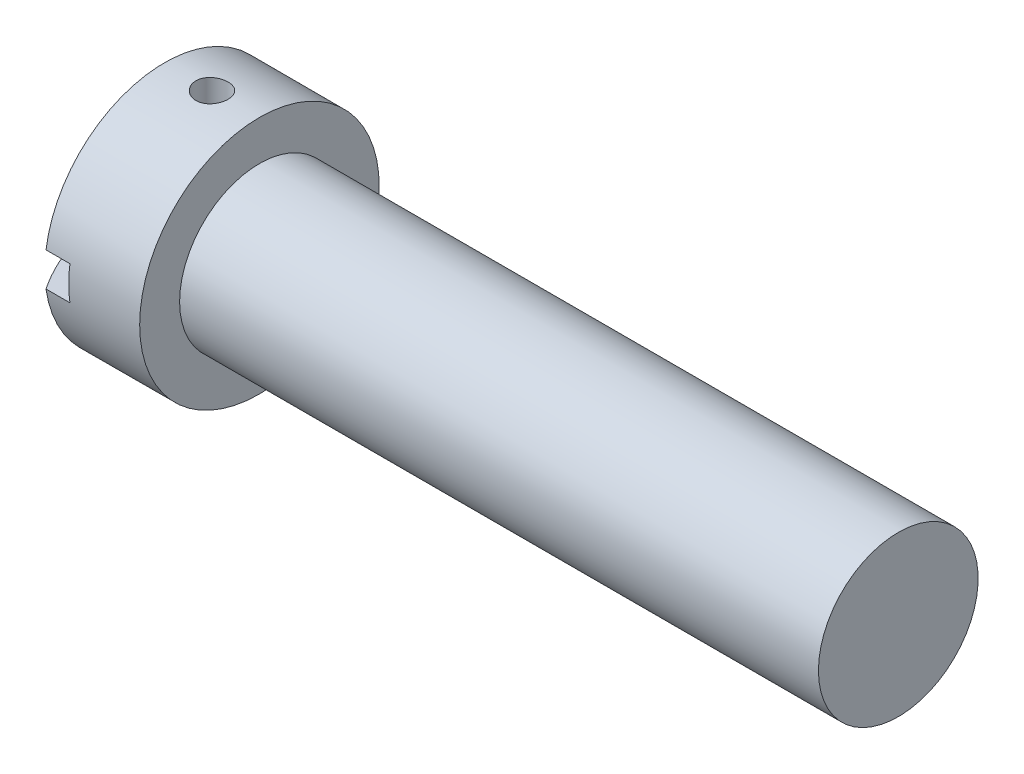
ISO-10303-21;
HEADER;
FILE_DESCRIPTION(('STEP AP214'),'2;1');
FILE_NAME('part.step','',(''),(''),'','','');
FILE_SCHEMA(('AUTOMOTIVE_DESIGN { 1 0 10303 214 1 1 1 1 }'));
ENDSEC;
DATA;
#1=APPLICATION_CONTEXT('core data for automotive mechanical design processes');
#2=APPLICATION_PROTOCOL_DEFINITION('international standard','automotive_design',2000,#1);
#3=PRODUCT_CONTEXT('',#1,'mechanical');
#4=PRODUCT('Part','Part','',(#3));
#5=PRODUCT_RELATED_PRODUCT_CATEGORY('part','',(#4));
#6=PRODUCT_DEFINITION_FORMATION('','',#4);
#7=PRODUCT_DEFINITION_CONTEXT('part definition',#1,'design');
#8=PRODUCT_DEFINITION('design','',#6,#7);
#9=PRODUCT_DEFINITION_SHAPE('','',#8);
#10=(LENGTH_UNIT() NAMED_UNIT(*) SI_UNIT(.MILLI.,.METRE.));
#11=(NAMED_UNIT(*) PLANE_ANGLE_UNIT() SI_UNIT($,.RADIAN.));
#12=(NAMED_UNIT(*) SI_UNIT($,.STERADIAN.) SOLID_ANGLE_UNIT());
#13=UNCERTAINTY_MEASURE_WITH_UNIT(LENGTH_MEASURE(1.E-05),#10,'distance_accuracy_value','');
#14=(GEOMETRIC_REPRESENTATION_CONTEXT(3) GLOBAL_UNCERTAINTY_ASSIGNED_CONTEXT((#13)) GLOBAL_UNIT_ASSIGNED_CONTEXT((#10,
#11,#12)) REPRESENTATION_CONTEXT('',''));
#15=CARTESIAN_POINT('',(0.,0.,0.));
#16=DIRECTION('',(0.,0.,1.));
#17=DIRECTION('',(1.,0.,0.));
#18=AXIS2_PLACEMENT_3D('',#15,#16,#17);
#19=CARTESIAN_POINT('',(16.9903913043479,0.,0.));
#20=DIRECTION('',(-1.,0.,0.));
#21=DIRECTION('',(0.,1.,0.));
#22=AXIS2_PLACEMENT_3D('',#19,#20,#21);
#23=SPHERICAL_SURFACE('',#22,16.9903913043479);
#24=CARTESIAN_POINT('',(2.921,0.,0.));
#25=DIRECTION('',(-1.,0.,0.));
#26=DIRECTION('',(0.,0.,1.));
#27=AXIS2_PLACEMENT_3D('',#24,#25,#26);
#28=CIRCLE('',#27,9.525);
#29=CARTESIAN_POINT('',(2.921,-1.3462,-9.42938866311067));
#30=VERTEX_POINT('',#29);
#31=CARTESIAN_POINT('',(2.921,-1.3462,9.42938866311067));
#32=VERTEX_POINT('',#31);
#33=EDGE_CURVE('E99',#30,#32,#28,.T.);
#34=ORIENTED_EDGE('',*,*,#33,.T.);
#35=CARTESIAN_POINT('',(16.9903913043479,-1.3462,0.));
#36=DIRECTION('',(0.,1.,0.));
#37=DIRECTION('',(0.,0.,1.));
#38=AXIS2_PLACEMENT_3D('',#35,#36,#37);
#39=CIRCLE('',#38,16.9369755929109);
#40=EDGE_CURVE('E162',#32,#30,#39,.F.);
#41=ORIENTED_EDGE('',*,*,#40,.T.);
#42=EDGE_LOOP('',(#34,#41));
#43=FACE_BOUND('',#42,.T.);
#44=ADVANCED_FACE('F39',(#43),#23,.T.);
#45=CARTESIAN_POINT('',(2.921,1.3462,9.42938866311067));
#46=VERTEX_POINT('',#45);
#47=CARTESIAN_POINT('',(2.921,1.3462,-9.42938866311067));
#48=VERTEX_POINT('',#47);
#49=EDGE_CURVE('E105',#46,#48,#28,.T.);
#50=ORIENTED_EDGE('',*,*,#49,.T.);
#51=CARTESIAN_POINT('',(16.9903913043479,1.3462,0.));
#52=DIRECTION('',(0.,-1.,0.));
#53=DIRECTION('',(0.,0.,-1.));
#54=AXIS2_PLACEMENT_3D('',#51,#52,#53);
#55=CIRCLE('',#54,16.9369755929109);
#56=EDGE_CURVE('E159',#48,#46,#55,.F.);
#57=ORIENTED_EDGE('',*,*,#56,.T.);
#58=EDGE_LOOP('',(#50,#57));
#59=FACE_BOUND('',#58,.T.);
#60=ADVANCED_FACE('F150',(#59),#23,.T.);
#61=CARTESIAN_POINT('',(-25.4,0.,0.));
#62=DIRECTION('',(-1.,0.,0.));
#63=DIRECTION('',(0.,0.,1.));
#64=AXIS2_PLACEMENT_3D('',#61,#62,#63);
#65=CYLINDRICAL_SURFACE('',#64,9.525);
#66=CARTESIAN_POINT('',(6.69289999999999,-9.43875337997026,1.27889));
#67=CARTESIAN_POINT('',(6.76438757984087,-9.43875447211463,1.27888698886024));
#68=CARTESIAN_POINT('',(6.83591872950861,-9.43957430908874,1.27287572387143));
#69=CARTESIAN_POINT('',(6.97698709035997,-9.44276349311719,1.24899246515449));
#70=CARTESIAN_POINT('',(7.04652219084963,-9.44513442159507,1.23110836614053));
#71=CARTESIAN_POINT('',(7.18153577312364,-9.45115251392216,1.18401897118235));
#72=CARTESIAN_POINT('',(7.24701709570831,-9.45479877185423,1.15482170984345));
#73=CARTESIAN_POINT('',(7.37213965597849,-9.46295559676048,1.08595263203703));
#74=CARTESIAN_POINT('',(7.43178182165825,-9.46746602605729,1.04628248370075));
#75=CARTESIAN_POINT('',(7.54392817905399,-9.47687548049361,0.957320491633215));
#76=CARTESIAN_POINT('',(7.59638933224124,-9.48177659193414,0.907974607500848));
#77=CARTESIAN_POINT('',(7.69231228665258,-9.49139647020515,0.801178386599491));
#78=CARTESIAN_POINT('',(7.73577362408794,-9.49611522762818,0.743727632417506));
#79=CARTESIAN_POINT('',(7.81261930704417,-9.5048602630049,0.622079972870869));
#80=CARTESIAN_POINT('',(7.84596444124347,-9.50888382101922,0.557858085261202));
#81=CARTESIAN_POINT('',(7.90137985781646,-9.51576211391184,0.424662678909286));
#82=CARTESIAN_POINT('',(7.92345062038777,-9.51861689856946,0.355689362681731));
#83=CARTESIAN_POINT('',(7.95556147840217,-9.52282128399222,0.215390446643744));
#84=CARTESIAN_POINT('',(7.96567334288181,-9.52417986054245,0.144081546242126));
#85=CARTESIAN_POINT('',(7.97380193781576,-9.52526944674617,0.000766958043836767));
#86=CARTESIAN_POINT('',(7.97181921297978,-9.52500052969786,-0.0712386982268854));
#87=CARTESIAN_POINT('',(7.95587211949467,-9.52287265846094,-0.213414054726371));
#88=CARTESIAN_POINT('',(7.94198494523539,-9.52102394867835,-0.283592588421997));
#89=CARTESIAN_POINT('',(7.90274400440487,-9.51595567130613,-0.420614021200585));
#90=CARTESIAN_POINT('',(7.87738999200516,-9.51273607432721,-0.487456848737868));
#91=CARTESIAN_POINT('',(7.81585406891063,-9.5052701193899,-0.616146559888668));
#92=CARTESIAN_POINT('',(7.7796390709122,-9.50102063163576,-0.677977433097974));
#93=CARTESIAN_POINT('',(7.69743328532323,-9.49196969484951,-0.794713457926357));
#94=CARTESIAN_POINT('',(7.65144198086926,-9.48716821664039,-0.84961824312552));
#95=CARTESIAN_POINT('',(7.55055755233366,-9.47750531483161,-0.951397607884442));
#96=CARTESIAN_POINT('',(7.49559710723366,-9.47264371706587,-0.998205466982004));
#97=CARTESIAN_POINT('',(7.37856489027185,-9.46344571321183,-1.08194286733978));
#98=CARTESIAN_POINT('',(7.3164930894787,-9.45910930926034,-1.11887236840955));
#99=CARTESIAN_POINT('',(7.18693718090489,-9.45145278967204,-1.1818103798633));
#100=CARTESIAN_POINT('',(7.11945018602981,-9.44813322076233,-1.20781301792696));
#101=CARTESIAN_POINT('',(6.98101287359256,-9.44289652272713,-1.24809724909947));
#102=CARTESIAN_POINT('',(6.91006274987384,-9.44097931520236,-1.26237949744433));
#103=CARTESIAN_POINT('',(6.76730398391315,-9.43877895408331,-1.27872807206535));
#104=CARTESIAN_POINT('',(6.69550630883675,-9.43848320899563,-1.28088853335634));
#105=CARTESIAN_POINT('',(6.55257311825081,-9.43952591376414,-1.27318107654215));
#106=CARTESIAN_POINT('',(6.48143758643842,-9.44086432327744,-1.26331345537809));
#107=CARTESIAN_POINT('',(6.34213338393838,-9.44501301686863,-1.23190940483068));
#108=CARTESIAN_POINT('',(6.27395414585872,-9.44781749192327,-1.21041901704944));
#109=CARTESIAN_POINT('',(6.14216637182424,-9.45457758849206,-1.15642703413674));
#110=CARTESIAN_POINT('',(6.07855801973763,-9.45853325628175,-1.12392499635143));
#111=CARTESIAN_POINT('',(5.95729309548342,-9.46718002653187,-1.04860273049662));
#112=CARTESIAN_POINT('',(5.8996750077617,-9.4718754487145,-1.00572104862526));
#113=CARTESIAN_POINT('',(5.79241987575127,-9.48145931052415,-0.91094311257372));
#114=CARTESIAN_POINT('',(5.74278319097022,-9.48634775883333,-0.859046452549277));
#115=CARTESIAN_POINT('',(5.6525666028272,-9.49580578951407,-0.747299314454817));
#116=CARTESIAN_POINT('',(5.612048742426,-9.50037305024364,-0.687398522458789));
#117=CARTESIAN_POINT('',(5.54165028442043,-9.50863892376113,-0.561586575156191));
#118=CARTESIAN_POINT('',(5.51176944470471,-9.51233755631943,-0.495675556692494));
#119=CARTESIAN_POINT('',(5.46359453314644,-9.51843918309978,-0.359915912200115));
#120=CARTESIAN_POINT('',(5.44526528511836,-9.52084610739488,-0.29007995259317));
#121=CARTESIAN_POINT('',(5.4205996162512,-9.52410950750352,-0.148287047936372));
#122=CARTESIAN_POINT('',(5.41426256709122,-9.5249660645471,-0.076330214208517));
#123=CARTESIAN_POINT('',(5.41377417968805,-9.52503168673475,0.0670574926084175));
#124=CARTESIAN_POINT('',(5.41952743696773,-9.52425365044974,0.13848805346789));
#125=CARTESIAN_POINT('',(5.44285343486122,-9.52116326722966,0.279356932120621));
#126=CARTESIAN_POINT('',(5.46042615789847,-9.51885092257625,0.34879525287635));
#127=CARTESIAN_POINT('',(5.50686090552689,-9.51295052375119,0.483691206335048));
#128=CARTESIAN_POINT('',(5.5357176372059,-9.50936306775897,0.549150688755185));
#129=CARTESIAN_POINT('',(5.60389132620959,-9.50130855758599,0.674313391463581));
#130=CARTESIAN_POINT('',(5.64320848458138,-9.49684148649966,0.734016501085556));
#131=CARTESIAN_POINT('',(5.7315372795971,-9.48748364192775,0.846458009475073));
#132=CARTESIAN_POINT('',(5.78061974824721,-9.48258992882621,0.899140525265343));
#133=CARTESIAN_POINT('',(5.88693765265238,-9.47295330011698,0.995557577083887));
#134=CARTESIAN_POINT('',(5.94417500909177,-9.4682104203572,1.03928999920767));
#135=CARTESIAN_POINT('',(6.06547378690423,-9.45938989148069,1.11673562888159));
#136=CARTESIAN_POINT('',(6.1295644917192,-9.4553153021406,1.15040330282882));
#137=CARTESIAN_POINT('',(6.26251128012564,-9.44832850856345,1.20644856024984));
#138=CARTESIAN_POINT('',(6.33136217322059,-9.4454150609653,1.22883822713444));
#139=CARTESIAN_POINT('',(6.4492780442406,-9.44177593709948,1.25642845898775));
#140=CARTESIAN_POINT('',(6.49760428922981,-9.4406482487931,1.26483915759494));
#141=CARTESIAN_POINT('',(6.59491353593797,-9.43913659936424,1.27607093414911));
#142=CARTESIAN_POINT('',(6.64389653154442,-9.43875263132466,1.27889206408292));
#143=CARTESIAN_POINT('',(6.69289999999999,-9.43875337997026,1.27889));
#144=B_SPLINE_CURVE_WITH_KNOTS('',3,(#66,#67,#68,#69,#70,#71,#72,#73,#74,#75,#76,#77,#78,#79,
#80,#81,#82,#83,#84,#85,#86,#87,#88,#89,#90,#91,#92,#93,#94,#95,#96,#97,#98,#99,#100,#101,#102,
#103,#104,#105,#106,#107,#108,#109,#110,#111,#112,#113,#114,#115,#116,#117,#118,#119,#120,#121,
#122,#123,#124,#125,#126,#127,#128,#129,#130,#131,#132,#133,#134,#135,#136,#137,#138,#139,#140,
#141,#142,#143),.UNSPECIFIED.,.T.,.F.,(4,2,2,2,2,2,2,2,2,2,2,2,2,2,2,2,2,2,2,2,2,2,2,2,2,2,2,2,
2,2,2,2,2,2,2,2,2,2,4),(0.,0.214283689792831,0.42878619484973,0.643136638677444,
0.857452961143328,1.07300223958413,1.28856262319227,1.50494816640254,1.72132449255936,
1.93639557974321,2.15145698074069,2.36513427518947,2.57881615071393,2.79315572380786,
3.00750663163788,3.22354742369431,3.43958909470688,3.65574672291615,3.87189226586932,
4.08635692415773,4.3008162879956,4.51443226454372,4.7280568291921,4.94297852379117,
5.15790989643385,5.37426216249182,5.59060950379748,5.80629481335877,6.02196882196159,
6.23594734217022,6.44992554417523,6.66380349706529,6.87768556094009,7.09317961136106,
7.30872450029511,7.52523026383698,7.74150356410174,7.88839260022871,8.03528027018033),.UNSPECIFIED.);
#145=CARTESIAN_POINT('',(6.69289999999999,-9.43875337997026,1.27889));
#146=VERTEX_POINT('',#145);
#147=EDGE_CURVE('E43',#146,#146,#144,.T.);
#148=ORIENTED_EDGE('',*,*,#147,.T.);
#149=EDGE_LOOP('',(#148));
#150=FACE_BOUND('',#149,.T.);
#151=CARTESIAN_POINT('',(6.69289999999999,9.43875337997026,1.27889));
#152=CARTESIAN_POINT('',(6.62141242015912,9.43875447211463,1.27888698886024));
#153=CARTESIAN_POINT('',(6.54988127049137,9.43957430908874,1.27287572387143));
#154=CARTESIAN_POINT('',(6.40881290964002,9.44276349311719,1.2489924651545));
#155=CARTESIAN_POINT('',(6.33927780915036,9.44513442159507,1.23110836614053));
#156=CARTESIAN_POINT('',(6.20426422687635,9.45115251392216,1.18401897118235));
#157=CARTESIAN_POINT('',(6.13878290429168,9.45479877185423,1.15482170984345));
#158=CARTESIAN_POINT('',(6.0136603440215,9.46295559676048,1.08595263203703));
#159=CARTESIAN_POINT('',(5.95401817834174,9.46746602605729,1.04628248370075));
#160=CARTESIAN_POINT('',(5.841871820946,9.47687548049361,0.957320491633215));
#161=CARTESIAN_POINT('',(5.78941066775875,9.48177659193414,0.907974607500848));
#162=CARTESIAN_POINT('',(5.69348771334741,9.49139647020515,0.801178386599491));
#163=CARTESIAN_POINT('',(5.65002637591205,9.49611522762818,0.743727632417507));
#164=CARTESIAN_POINT('',(5.57318069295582,9.5048602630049,0.622079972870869));
#165=CARTESIAN_POINT('',(5.53983555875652,9.50888382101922,0.557858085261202));
#166=CARTESIAN_POINT('',(5.48442014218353,9.51576211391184,0.424662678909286));
#167=CARTESIAN_POINT('',(5.46234937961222,9.51861689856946,0.355689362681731));
#168=CARTESIAN_POINT('',(5.43023852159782,9.52282128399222,0.215390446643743));
#169=CARTESIAN_POINT('',(5.42012665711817,9.52417986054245,0.144081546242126));
#170=CARTESIAN_POINT('',(5.41199806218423,9.52526944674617,0.000766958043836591));
#171=CARTESIAN_POINT('',(5.41398078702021,9.52500052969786,-0.0712386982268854));
#172=CARTESIAN_POINT('',(5.42992788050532,9.52287265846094,-0.213414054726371));
#173=CARTESIAN_POINT('',(5.4438150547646,9.52102394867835,-0.283592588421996));
#174=CARTESIAN_POINT('',(5.48305599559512,9.51595567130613,-0.420614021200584));
#175=CARTESIAN_POINT('',(5.50841000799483,9.51273607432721,-0.487456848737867));
#176=CARTESIAN_POINT('',(5.56994593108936,9.5052701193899,-0.616146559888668));
#177=CARTESIAN_POINT('',(5.60616092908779,9.50102063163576,-0.677977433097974));
#178=CARTESIAN_POINT('',(5.68836671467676,9.49196969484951,-0.794713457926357));
#179=CARTESIAN_POINT('',(5.73435801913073,9.48716821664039,-0.84961824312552));
#180=CARTESIAN_POINT('',(5.83524244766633,9.47750531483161,-0.951397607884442));
#181=CARTESIAN_POINT('',(5.89020289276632,9.47264371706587,-0.998205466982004));
#182=CARTESIAN_POINT('',(6.00723510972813,9.46344571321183,-1.08194286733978));
#183=CARTESIAN_POINT('',(6.06930691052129,9.45910930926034,-1.11887236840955));
#184=CARTESIAN_POINT('',(6.1988628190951,9.45145278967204,-1.1818103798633));
#185=CARTESIAN_POINT('',(6.26634981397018,9.44813322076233,-1.20781301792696));
#186=CARTESIAN_POINT('',(6.40478712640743,9.44289652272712,-1.24809724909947));
#187=CARTESIAN_POINT('',(6.47573725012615,9.44097931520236,-1.26237949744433));
#188=CARTESIAN_POINT('',(6.61849601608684,9.43877895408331,-1.27872807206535));
#189=CARTESIAN_POINT('',(6.69029369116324,9.43848320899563,-1.28088853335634));
#190=CARTESIAN_POINT('',(6.83322688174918,9.43952591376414,-1.27318107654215));
#191=CARTESIAN_POINT('',(6.90436241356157,9.44086432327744,-1.26331345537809));
#192=CARTESIAN_POINT('',(7.04366661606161,9.44501301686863,-1.23190940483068));
#193=CARTESIAN_POINT('',(7.11184585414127,9.44781749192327,-1.21041901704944));
#194=CARTESIAN_POINT('',(7.24363362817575,9.45457758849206,-1.15642703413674));
#195=CARTESIAN_POINT('',(7.30724198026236,9.45853325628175,-1.12392499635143));
#196=CARTESIAN_POINT('',(7.42850690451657,9.46718002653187,-1.04860273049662));
#197=CARTESIAN_POINT('',(7.48612499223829,9.4718754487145,-1.00572104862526));
#198=CARTESIAN_POINT('',(7.59338012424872,9.48145931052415,-0.91094311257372));
#199=CARTESIAN_POINT('',(7.64301680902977,9.48634775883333,-0.859046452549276));
#200=CARTESIAN_POINT('',(7.73323339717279,9.49580578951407,-0.747299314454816));
#201=CARTESIAN_POINT('',(7.77375125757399,9.50037305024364,-0.687398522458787));
#202=CARTESIAN_POINT('',(7.84414971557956,9.50863892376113,-0.56158657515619));
#203=CARTESIAN_POINT('',(7.87403055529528,9.51233755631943,-0.495675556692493));
#204=CARTESIAN_POINT('',(7.92220546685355,9.51843918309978,-0.359915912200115));
#205=CARTESIAN_POINT('',(7.94053471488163,9.52084610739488,-0.290079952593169));
#206=CARTESIAN_POINT('',(7.96520038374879,9.52410950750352,-0.148287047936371));
#207=CARTESIAN_POINT('',(7.97153743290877,9.5249660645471,-0.0763302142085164));
#208=CARTESIAN_POINT('',(7.97202582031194,9.52503168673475,0.0670574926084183));
#209=CARTESIAN_POINT('',(7.96627256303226,9.52425365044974,0.13848805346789));
#210=CARTESIAN_POINT('',(7.94294656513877,9.52116326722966,0.279356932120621));
#211=CARTESIAN_POINT('',(7.92537384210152,9.51885092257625,0.348795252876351));
#212=CARTESIAN_POINT('',(7.8789390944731,9.51295052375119,0.483691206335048));
#213=CARTESIAN_POINT('',(7.85008236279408,9.50936306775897,0.549150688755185));
#214=CARTESIAN_POINT('',(7.7819086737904,9.50130855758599,0.674313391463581));
#215=CARTESIAN_POINT('',(7.74259151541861,9.49684148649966,0.734016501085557));
#216=CARTESIAN_POINT('',(7.65426272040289,9.48748364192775,0.846458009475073));
#217=CARTESIAN_POINT('',(7.60518025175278,9.48258992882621,0.899140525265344));
#218=CARTESIAN_POINT('',(7.49886234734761,9.47295330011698,0.995557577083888));
#219=CARTESIAN_POINT('',(7.44162499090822,9.4682104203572,1.03928999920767));
#220=CARTESIAN_POINT('',(7.32032621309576,9.45938989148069,1.11673562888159));
#221=CARTESIAN_POINT('',(7.25623550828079,9.4553153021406,1.15040330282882));
#222=CARTESIAN_POINT('',(7.12328871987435,9.44832850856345,1.20644856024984));
#223=CARTESIAN_POINT('',(7.0544378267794,9.4454150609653,1.22883822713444));
#224=CARTESIAN_POINT('',(6.93652195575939,9.44177593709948,1.25642845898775));
#225=CARTESIAN_POINT('',(6.88819571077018,9.4406482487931,1.26483915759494));
#226=CARTESIAN_POINT('',(6.79088646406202,9.43913659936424,1.27607093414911));
#227=CARTESIAN_POINT('',(6.74190346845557,9.43875263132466,1.27889206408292));
#228=CARTESIAN_POINT('',(6.69289999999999,9.43875337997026,1.27889));
#229=B_SPLINE_CURVE_WITH_KNOTS('',3,(#151,#152,#153,#154,#155,#156,#157,#158,#159,#160,#161,
#162,#163,#164,#165,#166,#167,#168,#169,#170,#171,#172,#173,#174,#175,#176,#177,#178,#179,#180,
#181,#182,#183,#184,#185,#186,#187,#188,#189,#190,#191,#192,#193,#194,#195,#196,#197,#198,#199,
#200,#201,#202,#203,#204,#205,#206,#207,#208,#209,#210,#211,#212,#213,#214,#215,#216,#217,#218,
#219,#220,#221,#222,#223,#224,#225,#226,#227,#228),.UNSPECIFIED.,.T.,.F.,(4,2,2,2,2,2,2,2,2,2,2,
2,2,2,2,2,2,2,2,2,2,2,2,2,2,2,2,2,2,2,2,2,2,2,2,2,2,2,4),(0.,0.214283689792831,0.42878619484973,
0.643136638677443,0.857452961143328,1.07300223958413,1.28856262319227,1.50494816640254,
1.72132449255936,1.93639557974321,2.15145698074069,2.36513427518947,2.57881615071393,
2.79315572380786,3.00750663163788,3.22354742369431,3.43958909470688,3.65574672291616,
3.87189226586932,4.08635692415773,4.3008162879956,4.51443226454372,4.7280568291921,
4.94297852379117,5.15790989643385,5.37426216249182,5.59060950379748,5.80629481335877,
6.02196882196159,6.23594734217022,6.44992554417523,6.66380349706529,6.87768556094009,
7.09317961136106,7.30872450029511,7.52523026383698,7.74150356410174,7.88839260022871,
8.03528027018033),.UNSPECIFIED.);
#230=CARTESIAN_POINT('',(6.69289999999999,9.43875337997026,1.27889));
#231=VERTEX_POINT('',#230);
#232=EDGE_CURVE('E120',#231,#231,#229,.T.);
#233=ORIENTED_EDGE('',*,*,#232,.T.);
#234=EDGE_LOOP('',(#233));
#235=FACE_BOUND('',#234,.T.);
#236=CARTESIAN_POINT('',(10.4648,0.,0.));
#237=DIRECTION('',(-1.,0.,0.));
#238=DIRECTION('',(0.,0.,1.));
#239=AXIS2_PLACEMENT_3D('',#236,#237,#238);
#240=CIRCLE('',#239,9.525);
#241=CARTESIAN_POINT('',(10.4648,0.,9.525));
#242=VERTEX_POINT('',#241);
#243=EDGE_CURVE('E101',#242,#242,#240,.T.);
#244=ORIENTED_EDGE('',*,*,#243,.T.);
#245=EDGE_LOOP('',(#244));
#246=FACE_BOUND('',#245,.T.);
#247=DIRECTION('',(-1.,0.,0.));
#248=VECTOR('',#247,1.);
#249=CARTESIAN_POINT('',(-25.4,-1.3462,-9.42938866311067));
#250=LINE('',#249,#248);
#251=CARTESIAN_POINT('',(4.826,-1.3462,-9.42938866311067));
#252=VERTEX_POINT('',#251);
#253=EDGE_CURVE('E11',#252,#30,#250,.T.);
#254=ORIENTED_EDGE('',*,*,#253,.F.);
#255=CARTESIAN_POINT('',(4.826,0.,0.));
#256=DIRECTION('',(-1.,0.,0.));
#257=DIRECTION('',(0.,0.,1.));
#258=AXIS2_PLACEMENT_3D('',#255,#256,#257);
#259=CIRCLE('',#258,9.525);
#260=CARTESIAN_POINT('',(4.826,1.3462,-9.42938866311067));
#261=VERTEX_POINT('',#260);
#262=EDGE_CURVE('E82',#261,#252,#259,.T.);
#263=ORIENTED_EDGE('',*,*,#262,.F.);
#264=DIRECTION('',(-1.,0.,0.));
#265=VECTOR('',#264,1.);
#266=CARTESIAN_POINT('',(-25.4,1.3462,-9.42938866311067));
#267=LINE('',#266,#265);
#268=EDGE_CURVE('E52',#48,#261,#267,.F.);
#269=ORIENTED_EDGE('',*,*,#268,.F.);
#270=ORIENTED_EDGE('',*,*,#49,.F.);
#271=DIRECTION('',(-1.,0.,0.));
#272=VECTOR('',#271,1.);
#273=CARTESIAN_POINT('',(-25.4,1.3462,9.42938866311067));
#274=LINE('',#273,#272);
#275=CARTESIAN_POINT('',(4.826,1.3462,9.42938866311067));
#276=VERTEX_POINT('',#275);
#277=EDGE_CURVE('E112',#276,#46,#274,.T.);
#278=ORIENTED_EDGE('',*,*,#277,.F.);
#279=CARTESIAN_POINT('',(4.826,-1.3462,9.42938866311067));
#280=VERTEX_POINT('',#279);
#281=EDGE_CURVE('E95',#280,#276,#259,.T.);
#282=ORIENTED_EDGE('',*,*,#281,.F.);
#283=DIRECTION('',(-1.,0.,0.));
#284=VECTOR('',#283,1.);
#285=CARTESIAN_POINT('',(-25.4,-1.3462,9.42938866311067));
#286=LINE('',#285,#284);
#287=EDGE_CURVE('E86',#32,#280,#286,.F.);
#288=ORIENTED_EDGE('',*,*,#287,.F.);
#289=ORIENTED_EDGE('',*,*,#33,.F.);
#290=EDGE_LOOP('',(#254,#263,#269,#270,#278,#282,#288,#289));
#291=FACE_BOUND('',#290,.T.);
#292=ADVANCED_FACE('F96',(#150,#235,#246,#291),#65,.T.);
#293=CARTESIAN_POINT('',(-25.4,0.,0.));
#294=DIRECTION('',(-1.,0.,0.));
#295=DIRECTION('',(0.,0.,1.));
#296=AXIS2_PLACEMENT_3D('',#293,#294,#295);
#297=CYLINDRICAL_SURFACE('',#296,6.35);
#298=CARTESIAN_POINT('',(61.2648,0.,0.));
#299=DIRECTION('',(-1.,0.,0.));
#300=DIRECTION('',(0.,0.,1.));
#301=AXIS2_PLACEMENT_3D('',#298,#299,#300);
#302=CIRCLE('',#301,6.35);
#303=CARTESIAN_POINT('',(61.2648,0.,6.35));
#304=VERTEX_POINT('',#303);
#305=EDGE_CURVE('E106',#304,#304,#302,.T.);
#306=ORIENTED_EDGE('',*,*,#305,.T.);
#307=EDGE_LOOP('',(#306));
#308=FACE_BOUND('',#307,.T.);
#309=CARTESIAN_POINT('',(10.4648,0.,0.));
#310=DIRECTION('',(-1.,0.,0.));
#311=DIRECTION('',(0.,0.,1.));
#312=AXIS2_PLACEMENT_3D('',#309,#310,#311);
#313=CIRCLE('',#312,6.35);
#314=CARTESIAN_POINT('',(10.4648,0.,6.35));
#315=VERTEX_POINT('',#314);
#316=EDGE_CURVE('E108',#315,#315,#313,.T.);
#317=ORIENTED_EDGE('',*,*,#316,.F.);
#318=EDGE_LOOP('',(#317));
#319=FACE_BOUND('',#318,.T.);
#320=ADVANCED_FACE('F41',(#308,#319),#297,.T.);
#321=CARTESIAN_POINT('',(61.2648,6.35,0.));
#322=DIRECTION('',(1.,0.,0.));
#323=DIRECTION('',(0.,0.,-1.));
#324=AXIS2_PLACEMENT_3D('',#321,#322,#323);
#325=PLANE('',#324);
#326=ORIENTED_EDGE('',*,*,#305,.F.);
#327=EDGE_LOOP('',(#326));
#328=FACE_BOUND('',#327,.T.);
#329=ADVANCED_FACE('F139',(#328),#325,.T.);
#330=CARTESIAN_POINT('',(10.4648,6.35,0.));
#331=DIRECTION('',(-1.,0.,0.));
#332=DIRECTION('',(0.,0.,1.));
#333=AXIS2_PLACEMENT_3D('',#330,#331,#332);
#334=PLANE('',#333);
#335=ORIENTED_EDGE('',*,*,#243,.F.);
#336=EDGE_LOOP('',(#335));
#337=FACE_BOUND('',#336,.T.);
#338=ORIENTED_EDGE('',*,*,#316,.T.);
#339=EDGE_LOOP('',(#338));
#340=FACE_BOUND('',#339,.T.);
#341=ADVANCED_FACE('F137',(#337,#340),#334,.F.);
#342=CARTESIAN_POINT('',(4.826,-1.3462,-9.525));
#343=DIRECTION('',(0.,1.,0.));
#344=DIRECTION('',(0.,0.,1.));
#345=AXIS2_PLACEMENT_3D('',#342,#343,#344);
#346=PLANE('',#345);
#347=ORIENTED_EDGE('',*,*,#253,.T.);
#348=ORIENTED_EDGE('',*,*,#40,.F.);
#349=ORIENTED_EDGE('',*,*,#287,.T.);
#350=DIRECTION('',(0.,0.,-1.));
#351=VECTOR('',#350,1.);
#352=CARTESIAN_POINT('',(4.826,-1.3462,-9.525));
#353=LINE('',#352,#351);
#354=EDGE_CURVE('E63',#280,#252,#353,.T.);
#355=ORIENTED_EDGE('',*,*,#354,.T.);
#356=EDGE_LOOP('',(#347,#348,#349,#355));
#357=FACE_BOUND('',#356,.T.);
#358=ADVANCED_FACE('F92',(#357),#346,.T.);
#359=CARTESIAN_POINT('',(4.826,1.3462,9.525));
#360=DIRECTION('',(0.,-1.,0.));
#361=DIRECTION('',(0.,0.,-1.));
#362=AXIS2_PLACEMENT_3D('',#359,#360,#361);
#363=PLANE('',#362);
#364=ORIENTED_EDGE('',*,*,#277,.T.);
#365=ORIENTED_EDGE('',*,*,#56,.F.);
#366=ORIENTED_EDGE('',*,*,#268,.T.);
#367=DIRECTION('',(0.,0.,1.));
#368=VECTOR('',#367,1.);
#369=CARTESIAN_POINT('',(4.826,1.3462,9.525));
#370=LINE('',#369,#368);
#371=EDGE_CURVE('E88',#261,#276,#370,.T.);
#372=ORIENTED_EDGE('',*,*,#371,.T.);
#373=EDGE_LOOP('',(#364,#365,#366,#372));
#374=FACE_BOUND('',#373,.T.);
#375=ADVANCED_FACE('F132',(#374),#363,.T.);
#376=CARTESIAN_POINT('',(4.826,-1.3462,9.525));
#377=DIRECTION('',(-1.,0.,0.));
#378=DIRECTION('',(0.,0.,1.));
#379=AXIS2_PLACEMENT_3D('',#376,#377,#378);
#380=PLANE('',#379);
#381=ORIENTED_EDGE('',*,*,#371,.F.);
#382=ORIENTED_EDGE('',*,*,#262,.T.);
#383=ORIENTED_EDGE('',*,*,#354,.F.);
#384=ORIENTED_EDGE('',*,*,#281,.T.);
#385=EDGE_LOOP('',(#381,#382,#383,#384));
#386=FACE_BOUND('',#385,.T.);
#387=ADVANCED_FACE('F85',(#386),#380,.T.);
#388=CARTESIAN_POINT('',(6.69289999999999,-635.762,0.));
#389=DIRECTION('',(0.,1.,0.));
#390=DIRECTION('',(0.,0.,1.));
#391=AXIS2_PLACEMENT_3D('',#388,#389,#390);
#392=CYLINDRICAL_SURFACE('',#391,1.27889);
#393=ORIENTED_EDGE('',*,*,#232,.F.);
#394=EDGE_LOOP('',(#393));
#395=FACE_BOUND('',#394,.T.);
#396=ORIENTED_EDGE('',*,*,#147,.F.);
#397=EDGE_LOOP('',(#396));
#398=FACE_BOUND('',#397,.T.);
#399=ADVANCED_FACE('F123',(#395,#398),#392,.F.);
#400=CLOSED_SHELL('',(#44,#60,#292,#320,#329,#341,#358,#375,#387,#399));
#401=MANIFOLD_SOLID_BREP('B2',#400);
#402=ADVANCED_BREP_SHAPE_REPRESENTATION('',(#18,#401),#14);
#403=SHAPE_DEFINITION_REPRESENTATION(#9,#402);
ENDSEC;
END-ISO-10303-21;
